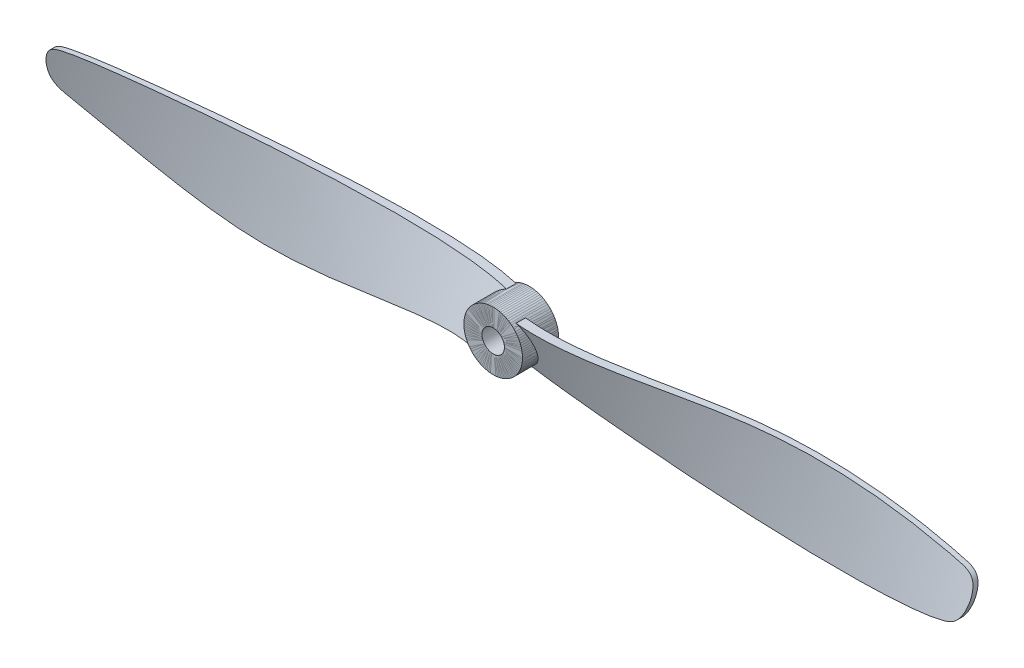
from build123d import *

# Parameters (mm, degrees)
ESQUISSE1_R                  = 6.5
BOSS_EXTRU_1_DEPTH           = 4
ENL_V_MAT_EXTRU_1_DEPTH      = 122.162953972
ENL_V_MAT_EXTRU_1_DEPTH_BACK = 122.162953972
R_P_TITION_CIRCULAIRE1_COUNT = 2
ESQUISSE5_R                  = 2.5
ENL_V_MAT_EXTRU_2_DEPTH      = 104.308379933


with BuildPart() as part:
    # Esquisse1 → Boss.-Extru.1 (new, symmetric)
    with BuildSketch(Plane.XY):
        Circle(ESQUISSE1_R)
    extrude(amount=BOSS_EXTRU_1_DEPTH, both=True)

    # Esquisse2 → Lissage1 section 0
    with BuildSketch(Plane(origin=(0, 0, 0), x_dir=(0, 0, -1), z_dir=(1, 0, 0))):
        with BuildLine():
            Line((-7.316056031, 14.264477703), (5.483000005, -15.064418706))
            Line((5.483000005, -15.064418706), (7.316056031, -14.264477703))
            Line((7.316056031, -14.264477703), (-5.483000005, 15.064418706))
            Line((-5.483000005, 15.064418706), (-7.316056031, 14.264477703))
        make_face()
    # Esquisse3 → Lissage1 section 1
    with BuildSketch(Plane(origin=(120, 0, 0), x_dir=(0, 0, -1), z_dir=(1, 0, 0))):
        with BuildLine():
            Line((5.474993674, 15.04242149), (-6.403544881, -14.67121716))
            Line((-6.403544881, -14.67121716), (-5.474993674, -15.04242149))
            Line((-5.474993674, -15.04242149), (6.403544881, 14.67121716))
            Line((6.403544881, 14.67121716), (5.474993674, 15.04242149))
        make_face()
    loft()

    # Esquisse4 → Enl_v. mat.-Extru.1 (cut, two sides: drawn at the far end of the back side and taken through both)
    with BuildSketch(Plane.XY.offset(-ENL_V_MAT_EXTRU_1_DEPTH_BACK)):
        with BuildLine():
            Line((0, 6.5), (-8.207246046, 6.5))
            Line((-8.207246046, 6.5), (-8.207246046, 20.064418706))
            Line((-8.207246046, 20.064418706), (124, 20.064418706))
            Line((124, 20.064418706), (124, -20.064418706))
            Line((124, -20.064418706), (-5, -20.064418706))
            Line((-5, -20.064418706), (-5, -6.5))
            Line((-5, -6.5), (0, -6.5))
            ThreePointArc((0, -6.5), (1.274754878, -6.373774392), (2.5, -6))
            add(Edge.make_bspline(
                [(2.5, -6), (20.960619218, -10.542423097), (92.093601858, -8.883775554), (102.019821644, -4.158737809), (103.567086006, 3.634059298), (88.21540274, 7.098686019), (52.999290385, 13.939941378), (14.143550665, 2.301193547), (4.153311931, 5)],
                knots=[0, 0, 0, 0, 0.222926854, 0.255088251, 0.314222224, 0.354121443, 0.646688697, 1, 1, 1, 1], degree=3))
            ThreePointArc((4.153311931, 5), (2.207940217, 6.11350963), (0, 6.5))
        make_face()
    extrude(amount=ENL_V_MAT_EXTRU_1_DEPTH + ENL_V_MAT_EXTRU_1_DEPTH_BACK, mode=Mode.SUBTRACT)


with BuildPart() as r_p_tition_circulaire1_1:
    # R_p_tition circulaire1: pattern copy
    add(part.part.rotate(Axis((0, 0, 4), (0, 0, -1)), 1 * 360 / R_P_TITION_CIRCULAIRE1_COUNT))


with BuildPart() as enl_v_mat_extru_2_tool:
    # Esquisse5 → Enl_v. mat.-Extru.2 (new, through all)
    with BuildSketch(Plane.XY.offset(4)):
        Circle(ESQUISSE5_R)
    extrude(amount=-ENL_V_MAT_EXTRU_2_DEPTH)


with BuildPart() as part_1:
    add(part.part)

    # Enl_v. mat.-Extru.2: cut by enl_v_mat_extru_2_tool
    add(enl_v_mat_extru_2_tool.part, mode=Mode.SUBTRACT)


with BuildPart() as r_p_tition_circulaire1_1_1:
    add(r_p_tition_circulaire1_1.part)

    # Enl_v. mat.-Extru.2: cut by enl_v_mat_extru_2_tool
    add(enl_v_mat_extru_2_tool.part, mode=Mode.SUBTRACT)


solid = Compound([part_1.part, r_p_tition_circulaire1_1_1.part])
